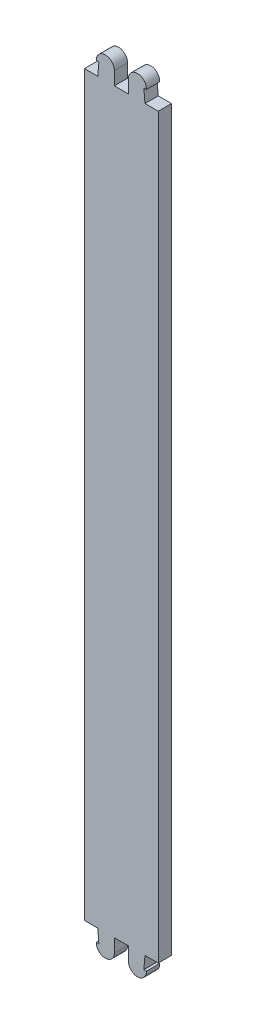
from build123d import *

# Parameters (mm, degrees)
BOSS_EXTRUDE1_DEPTH = 2.7


with BuildPart() as part:
    # Sketch1 → Boss-Extrude1 (new body)
    with BuildSketch(Plane.XY):
        with BuildLine():
            Line((7.50526, -112.5), (7.50526, 37.5))
            Line((7.50526, 37.5), (4.800095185, 37.5))
            Line((4.800095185, 37.5), (4.57, 40.13))
            Line((4.57, 40.13), (5.098404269, 40.13))
            ThreePointArc((5.098404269, 40.13), (3.299876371, 42.034536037), (1.43, 40.2))
            Line((1.43, 40.2), (1.43, 37.5))
            Line((1.43, 37.5), (-1.43, 37.5))
            Line((-1.43, 37.5), (-1.43, 40.2))
            ThreePointArc((-1.43, 40.2), (-3.299876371, 42.034536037), (-5.098404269, 40.13))
            Line((-5.098404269, 40.13), (-4.57, 40.13))
            Line((-4.57, 40.13), (-4.800095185, 37.5))
            Line((-4.800095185, 37.5), (-7.50526, 37.5))
            Line((-7.50526, 37.5), (-7.50526, -112.5))
            Line((-7.50526, -112.5), (-4.800095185, -112.5))
            Line((-4.800095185, -112.5), (-4.57, -115.13))
            Line((-4.57, -115.13), (-5.098404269, -115.13))
            ThreePointArc((-5.098404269, -115.13), (-3.299876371, -117.034536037), (-1.43, -115.2))
            Line((-1.43, -115.2), (-1.43, -112.5))
            Line((-1.43, -112.5), (1.43, -112.5))
            Line((1.43, -112.5), (1.43, -115.2))
            ThreePointArc((1.43, -115.2), (3.299876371, -117.034536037), (5.098404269, -115.13))
            Line((5.098404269, -115.13), (4.57, -115.13))
            Line((4.57, -115.13), (4.800095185, -112.5))
            Line((4.800095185, -112.5), (7.50526, -112.5))
        make_face()
    extrude(amount=BOSS_EXTRUDE1_DEPTH)


solid = part.part
